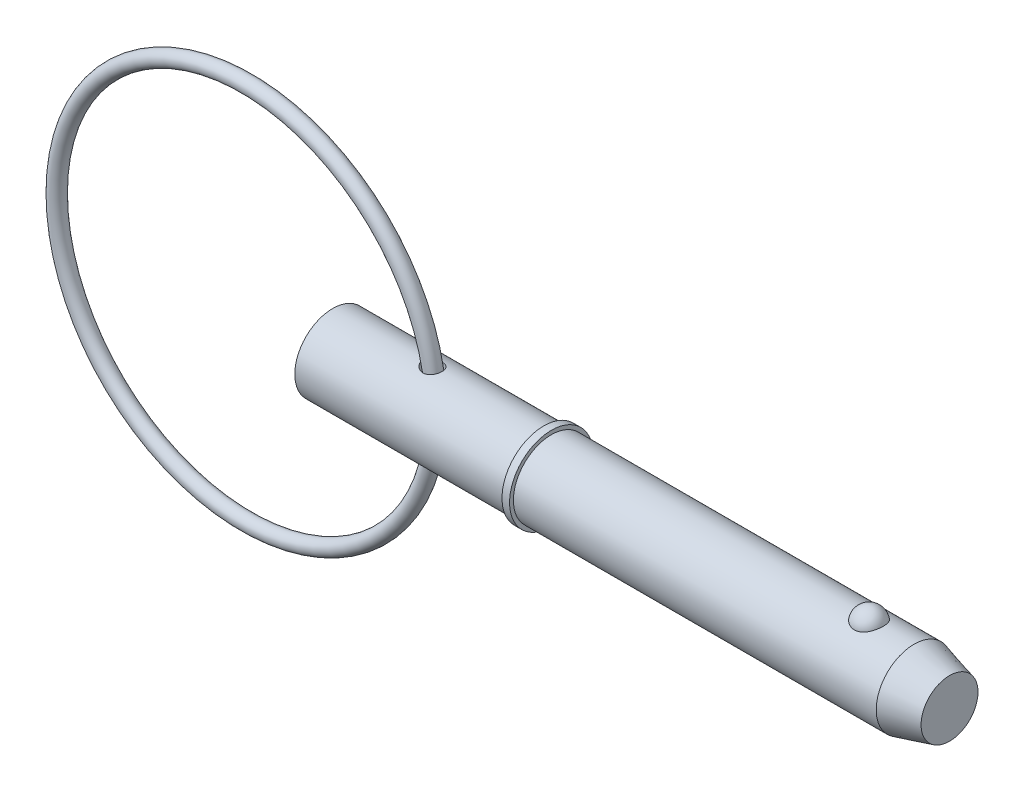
ISO-10303-21;
HEADER;
FILE_DESCRIPTION(('STEP AP214'),'2;1');
FILE_NAME('part.step','',(''),(''),'','','');
FILE_SCHEMA(('AUTOMOTIVE_DESIGN { 1 0 10303 214 1 1 1 1 }'));
ENDSEC;
DATA;
#1=APPLICATION_CONTEXT('core data for automotive mechanical design processes');
#2=APPLICATION_PROTOCOL_DEFINITION('international standard','automotive_design',2000,#1);
#3=PRODUCT_CONTEXT('',#1,'mechanical');
#4=PRODUCT('Part','Part','',(#3));
#5=PRODUCT_RELATED_PRODUCT_CATEGORY('part','',(#4));
#6=PRODUCT_DEFINITION_FORMATION('','',#4);
#7=PRODUCT_DEFINITION_CONTEXT('part definition',#1,'design');
#8=PRODUCT_DEFINITION('design','',#6,#7);
#9=PRODUCT_DEFINITION_SHAPE('','',#8);
#10=(LENGTH_UNIT() NAMED_UNIT(*) SI_UNIT(.MILLI.,.METRE.));
#11=(NAMED_UNIT(*) PLANE_ANGLE_UNIT() SI_UNIT($,.RADIAN.));
#12=(NAMED_UNIT(*) SI_UNIT($,.STERADIAN.) SOLID_ANGLE_UNIT());
#13=UNCERTAINTY_MEASURE_WITH_UNIT(LENGTH_MEASURE(1.E-05),#10,'distance_accuracy_value','');
#14=(GEOMETRIC_REPRESENTATION_CONTEXT(3) GLOBAL_UNCERTAINTY_ASSIGNED_CONTEXT((#13)) GLOBAL_UNIT_ASSIGNED_CONTEXT((#10,
#11,#12)) REPRESENTATION_CONTEXT('',''));
#15=CARTESIAN_POINT('',(0.,0.,0.));
#16=DIRECTION('',(0.,0.,1.));
#17=DIRECTION('',(1.,0.,0.));
#18=AXIS2_PLACEMENT_3D('',#15,#16,#17);
#19=CARTESIAN_POINT('',(-7.21857545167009,0.,0.));
#20=DIRECTION('',(0.,0.,1.));
#21=DIRECTION('',(1.,0.,0.));
#22=AXIS2_PLACEMENT_3D('',#19,#20,#21);
#23=TOROIDAL_SURFACE('',#22,15.875,0.634999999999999);
#24=CARTESIAN_POINT('',(9.29142454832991,0.,0.));
#25=VERTEX_POINT('',#24);
#26=VERTEX_LOOP('',#25);
#27=FACE_BOUND('',#26,.T.);
#28=ADVANCED_FACE('P0_F12',(#27),#23,.T.);
#29=CLOSED_SHELL('',(#28));
#30=MANIFOLD_SOLID_BREP('P0_B1',#29);
#31=CARTESIAN_POINT('',(0.,0.,0.));
#32=DIRECTION('',(1.,0.,0.));
#33=DIRECTION('',(0.,0.,-1.));
#34=AXIS2_PLACEMENT_3D('',#31,#32,#33);
#35=CYLINDRICAL_SURFACE('',#34,3.175);
#36=CARTESIAN_POINT('',(7.68750254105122,3.14043953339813,-0.467187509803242));
#37=CARTESIAN_POINT('',(7.71663570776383,3.13485007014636,-0.504758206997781));
#38=CARTESIAN_POINT('',(7.74907441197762,3.12895198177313,-0.539757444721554));
#39=CARTESIAN_POINT('',(7.81944011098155,3.11722901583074,-0.603799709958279));
#40=CARTESIAN_POINT('',(7.85737550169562,3.11140426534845,-0.632833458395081));
#41=CARTESIAN_POINT('',(7.93756775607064,3.10051072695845,-0.684213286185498));
#42=CARTESIAN_POINT('',(7.97981919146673,3.09544100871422,-0.706567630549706));
#43=CARTESIAN_POINT('',(8.06754397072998,3.08665483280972,-0.744015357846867));
#44=CARTESIAN_POINT('',(8.11301598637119,3.08293782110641,-0.759111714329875));
#45=CARTESIAN_POINT('',(8.20614871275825,3.07732974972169,-0.781538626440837));
#46=CARTESIAN_POINT('',(8.25381727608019,3.07544587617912,-0.788838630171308));
#47=CARTESIAN_POINT('',(8.34973955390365,3.07382984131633,-0.795114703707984));
#48=CARTESIAN_POINT('',(8.39799308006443,3.07409700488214,-0.794093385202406));
#49=CARTESIAN_POINT('',(8.4909727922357,3.07673252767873,-0.783815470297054));
#50=CARTESIAN_POINT('',(8.53575064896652,3.07898913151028,-0.774996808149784));
#51=CARTESIAN_POINT('',(8.62301664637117,3.08521060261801,-0.749844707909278));
#52=CARTESIAN_POINT('',(8.66550527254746,3.08917510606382,-0.733512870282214));
#53=CARTESIAN_POINT('',(8.74528857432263,3.09816330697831,-0.694543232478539));
#54=CARTESIAN_POINT('',(8.78272109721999,3.10313973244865,-0.672175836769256));
#55=CARTESIAN_POINT('',(8.85323831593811,3.11368155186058,-0.621513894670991));
#56=CARTESIAN_POINT('',(8.88632295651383,3.1192469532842,-0.59321927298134));
#57=CARTESIAN_POINT('',(8.94738786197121,3.13037258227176,-0.531394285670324));
#58=CARTESIAN_POINT('',(8.97535151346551,3.13593273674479,-0.497847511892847));
#59=CARTESIAN_POINT('',(9.02535984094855,3.14642822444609,-0.426512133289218));
#60=CARTESIAN_POINT('',(9.04740412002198,3.1513635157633,-0.388723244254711));
#61=CARTESIAN_POINT('',(9.08531615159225,3.16014674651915,-0.309373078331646));
#62=CARTESIAN_POINT('',(9.10109111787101,3.16397813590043,-0.267765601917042));
#63=CARTESIAN_POINT('',(9.12562372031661,3.17004373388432,-0.182419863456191));
#64=CARTESIAN_POINT('',(9.13438129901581,3.17227792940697,-0.138681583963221));
#65=CARTESIAN_POINT('',(9.14467797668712,3.17491257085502,-0.0501907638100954));
#66=CARTESIAN_POINT('',(9.14619790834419,3.17530814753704,-0.00543584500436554));
#67=CARTESIAN_POINT('',(9.14192925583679,3.17420952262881,0.0837005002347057));
#68=CARTESIAN_POINT('',(9.13614065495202,3.17271531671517,0.128081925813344));
#69=CARTESIAN_POINT('',(9.11741184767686,3.16800183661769,0.215146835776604));
#70=CARTESIAN_POINT('',(9.1044818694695,3.1647850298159,0.257832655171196));
#71=CARTESIAN_POINT('',(9.07179341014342,3.15697516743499,0.340371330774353));
#72=CARTESIAN_POINT('',(9.05203467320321,3.15238206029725,0.380224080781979));
#73=CARTESIAN_POINT('',(9.00612949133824,3.14231078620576,0.456042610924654));
#74=CARTESIAN_POINT('',(8.97997137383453,3.13683100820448,0.492001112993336));
#75=CARTESIAN_POINT('',(8.92194141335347,3.12560179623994,0.558920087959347));
#76=CARTESIAN_POINT('',(8.89006980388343,3.11985237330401,0.589880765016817));
#77=CARTESIAN_POINT('',(8.82164045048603,3.10876807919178,0.645751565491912));
#78=CARTESIAN_POINT('',(8.78510991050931,3.1034310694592,0.670694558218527));
#79=CARTESIAN_POINT('',(8.70823767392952,3.09374754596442,0.714035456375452));
#80=CARTESIAN_POINT('',(8.66789657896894,3.08940087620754,0.732434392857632));
#81=CARTESIAN_POINT('',(8.58520620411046,3.08224677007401,0.761976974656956));
#82=CARTESIAN_POINT('',(8.54289637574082,3.07941711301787,0.773225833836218));
#83=CARTESIAN_POINT('',(8.45693772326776,3.07549224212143,0.788693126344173));
#84=CARTESIAN_POINT('',(8.41328889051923,3.07439703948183,0.792911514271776));
#85=CARTESIAN_POINT('',(8.32565716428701,3.07402154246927,0.79436569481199));
#86=CARTESIAN_POINT('',(8.2816736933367,3.07475037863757,0.791566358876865));
#87=CARTESIAN_POINT('',(8.19474198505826,3.0779150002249,0.779168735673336));
#88=CARTESIAN_POINT('',(8.15179398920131,3.0803511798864,0.769568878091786));
#89=CARTESIAN_POINT('',(8.06605600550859,3.08678050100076,0.743371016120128));
#90=CARTESIAN_POINT('',(8.02336243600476,3.09083954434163,0.726473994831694));
#91=CARTESIAN_POINT('',(7.94127890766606,3.10003371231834,0.686178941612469));
#92=CARTESIAN_POINT('',(7.90189016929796,3.10516923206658,0.662778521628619));
#93=CARTESIAN_POINT('',(7.82556689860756,3.11622820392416,0.608722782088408));
#94=CARTESIAN_POINT('',(7.78884764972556,3.12217795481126,0.577767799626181));
#95=CARTESIAN_POINT('',(7.7212485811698,3.13396160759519,0.509990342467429));
#96=CARTESIAN_POINT('',(7.69036894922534,3.13979550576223,0.473167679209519));
#97=CARTESIAN_POINT('',(7.63604128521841,3.15055792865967,0.395137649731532));
#98=CARTESIAN_POINT('',(7.61248286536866,3.15549937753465,0.354009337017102));
#99=CARTESIAN_POINT('',(7.57323986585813,3.16396081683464,0.268021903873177));
#100=CARTESIAN_POINT('',(7.55754910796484,3.16748192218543,0.223165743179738));
#101=CARTESIAN_POINT('',(7.53586686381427,3.17240393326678,0.135111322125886));
#102=CARTESIAN_POINT('',(7.52916366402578,3.17395975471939,0.0920967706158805));
#103=CARTESIAN_POINT('',(7.52342449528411,3.1752897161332,0.00553088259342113));
#104=CARTESIAN_POINT('',(7.52438648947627,3.17506432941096,-0.0380203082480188));
#105=CARTESIAN_POINT('',(7.53361123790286,3.17293298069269,-0.121469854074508));
#106=CARTESIAN_POINT('',(7.54140526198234,3.17113493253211,-0.161424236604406));
#107=CARTESIAN_POINT('',(7.56329403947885,3.16619862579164,-0.239454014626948));
#108=CARTESIAN_POINT('',(7.57738500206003,3.16306117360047,-0.277530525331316));
#109=CARTESIAN_POINT('',(7.60689714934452,3.15670852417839,-0.341419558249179));
#110=CARTESIAN_POINT('',(7.62103486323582,3.15372268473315,-0.367859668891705));
#111=CARTESIAN_POINT('',(7.65218035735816,3.14734507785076,-0.418934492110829));
#112=CARTESIAN_POINT('',(7.66918829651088,3.14395328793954,-0.443569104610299));
#113=CARTESIAN_POINT('',(7.68750254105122,3.14043953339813,-0.467187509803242));
#114=B_SPLINE_CURVE_WITH_KNOTS('',3,(#36,#37,#38,#39,#40,#41,#42,#43,#44,#45,#46,#47,#48,#49,
#50,#51,#52,#53,#54,#55,#56,#57,#58,#59,#60,#61,#62,#63,#64,#65,#66,#67,#68,#69,#70,#71,#72,#73,
#74,#75,#76,#77,#78,#79,#80,#81,#82,#83,#84,#85,#86,#87,#88,#89,#90,#91,#92,#93,#94,#95,#96,#97,
#98,#99,#100,#101,#102,#103,#104,#105,#106,#107,#108,#109,#110,#111,#112,#113),.UNSPECIFIED.,
.T.,.F.,(4,2,2,2,2,2,2,2,2,2,2,2,2,2,2,2,2,2,2,2,2,2,2,2,2,2,2,2,2,2,2,2,2,2,2,2,2,2,4),(0.,
0.143496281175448,0.287214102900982,0.430753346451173,0.574233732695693,0.71827434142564,
0.862269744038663,0.998657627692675,1.13501647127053,1.26606395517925,1.39711310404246,
1.52858014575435,1.66005600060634,1.79341107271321,1.92676723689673,2.06047636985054,
2.19418580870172,2.32770423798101,2.46122766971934,2.59499649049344,2.72875984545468,
2.86177513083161,2.99476944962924,3.12575845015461,3.25674829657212,3.38839514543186,
3.5200724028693,3.65775119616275,3.79548061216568,3.93996868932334,4.08446141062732,
4.22665598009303,4.36873871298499,4.49873145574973,4.62868965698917,4.7503735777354,
4.87198434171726,4.96218670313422,5.05239406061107),.UNSPECIFIED.);
#115=CARTESIAN_POINT('',(7.68750254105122,3.14043953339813,-0.467187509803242));
#116=VERTEX_POINT('',#115);
#117=EDGE_CURVE('P1_E42',#116,#116,#114,.T.);
#118=ORIENTED_EDGE('',*,*,#117,.T.);
#119=EDGE_LOOP('',(#118));
#120=FACE_BOUND('',#119,.T.);
#121=CARTESIAN_POINT('',(0.,0.,0.));
#122=DIRECTION('',(1.,0.,0.));
#123=DIRECTION('',(0.,0.,-1.));
#124=AXIS2_PLACEMENT_3D('',#121,#122,#123);
#125=CIRCLE('',#124,3.175);
#126=CARTESIAN_POINT('',(0.,0.,-3.175));
#127=VERTEX_POINT('',#126);
#128=EDGE_CURVE('P1_E9',#127,#127,#125,.T.);
#129=ORIENTED_EDGE('',*,*,#128,.T.);
#130=EDGE_LOOP('',(#129));
#131=FACE_BOUND('',#130,.T.);
#132=CARTESIAN_POINT('',(17.655,0.,0.));
#133=DIRECTION('',(1.,0.,0.));
#134=DIRECTION('',(0.,0.,-1.));
#135=AXIS2_PLACEMENT_3D('',#132,#133,#134);
#136=CIRCLE('',#135,3.175);
#137=CARTESIAN_POINT('',(17.655,0.,-3.175));
#138=VERTEX_POINT('',#137);
#139=EDGE_CURVE('P1_E25',#138,#138,#136,.T.);
#140=ORIENTED_EDGE('',*,*,#139,.F.);
#141=EDGE_LOOP('',(#140));
#142=FACE_BOUND('',#141,.T.);
#143=CARTESIAN_POINT('',(7.68750254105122,-3.14043953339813,-0.467187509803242));
#144=CARTESIAN_POINT('',(7.66134108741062,-3.14545876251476,-0.433446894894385));
#145=CARTESIAN_POINT('',(7.63782862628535,-3.15023199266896,-0.397612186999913));
#146=CARTESIAN_POINT('',(7.59691922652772,-3.15880505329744,-0.322493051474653));
#147=CARTESIAN_POINT('',(7.57952031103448,-3.16260519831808,-0.283209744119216));
#148=CARTESIAN_POINT('',(7.55152687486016,-3.16882833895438,-0.202021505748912));
#149=CARTESIAN_POINT('',(7.54095517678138,-3.17124671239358,-0.160108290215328));
#150=CARTESIAN_POINT('',(7.52724513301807,-3.1743985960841,-0.0750206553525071));
#151=CARTESIAN_POINT('',(7.52410469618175,-3.17513258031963,-0.031846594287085));
#152=CARTESIAN_POINT('',(7.5253875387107,-3.17483506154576,0.0522260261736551));
#153=CARTESIAN_POINT('',(7.52944265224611,-3.17388949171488,0.0931310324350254));
#154=CARTESIAN_POINT('',(7.54421042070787,-3.17050389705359,0.1736507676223));
#155=CARTESIAN_POINT('',(7.5549232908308,-3.16806382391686,0.213265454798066));
#156=CARTESIAN_POINT('',(7.58252065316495,-3.16195002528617,0.290147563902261));
#157=CARTESIAN_POINT('',(7.59940259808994,-3.15827680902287,0.32741594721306));
#158=CARTESIAN_POINT('',(7.63869293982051,-3.15005936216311,0.398803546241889));
#159=CARTESIAN_POINT('',(7.66110286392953,-3.14551489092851,0.432921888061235));
#160=CARTESIAN_POINT('',(7.71258278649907,-3.13561737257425,0.49975352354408));
#161=CARTESIAN_POINT('',(7.74202268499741,-3.13022938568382,0.532176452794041));
#162=CARTESIAN_POINT('',(7.80559890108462,-3.11946135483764,0.592041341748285));
#163=CARTESIAN_POINT('',(7.83973728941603,-3.11408131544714,0.619481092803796));
#164=CARTESIAN_POINT('',(7.91474520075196,-3.10344314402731,0.670826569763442));
#165=CARTESIAN_POINT('',(7.95593439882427,-3.09822894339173,0.694276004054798));
#166=CARTESIAN_POINT('',(8.04171965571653,-3.08902387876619,0.734150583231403));
#167=CARTESIAN_POINT('',(8.08631621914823,-3.08503319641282,0.750574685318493));
#168=CARTESIAN_POINT('',(8.17840269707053,-3.07873340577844,0.776016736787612));
#169=CARTESIAN_POINT('',(8.22592511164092,-3.07644943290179,0.784924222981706));
#170=CARTESIAN_POINT('',(8.3218479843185,-3.07400734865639,0.79443684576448));
#171=CARTESIAN_POINT('',(8.37024809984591,-3.07384842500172,0.79504515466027));
#172=CARTESIAN_POINT('',(8.46394967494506,-3.07568838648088,0.787894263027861));
#173=CARTESIAN_POINT('',(8.50928504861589,-3.07757975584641,0.78055200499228));
#174=CARTESIAN_POINT('',(8.5979121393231,-3.0831587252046,0.758214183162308));
#175=CARTESIAN_POINT('',(8.6412043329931,-3.08684590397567,0.743220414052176));
#176=CARTESIAN_POINT('',(8.72259527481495,-3.09539071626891,0.706762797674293));
#177=CARTESIAN_POINT('',(8.7608371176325,-3.10019138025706,0.685603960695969));
#178=CARTESIAN_POINT('',(8.83314563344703,-3.11049979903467,0.637201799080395));
#179=CARTESIAN_POINT('',(8.86721230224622,-3.11600755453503,0.609958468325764));
#180=CARTESIAN_POINT('',(8.93027727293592,-3.12712026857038,0.550151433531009));
#181=CARTESIAN_POINT('',(8.95927559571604,-3.13272522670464,0.517587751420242));
#182=CARTESIAN_POINT('',(9.01149093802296,-3.14342495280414,0.448041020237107));
#183=CARTESIAN_POINT('',(9.03470756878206,-3.14851968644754,0.411057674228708));
#184=CARTESIAN_POINT('',(9.07510046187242,-3.15772445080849,0.333109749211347));
#185=CARTESIAN_POINT('',(9.09218248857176,-3.16181883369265,0.292094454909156));
#186=CARTESIAN_POINT('',(9.11940464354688,-3.16848144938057,0.207703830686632));
#187=CARTESIAN_POINT('',(9.12954467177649,-3.17104966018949,0.164328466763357));
#188=CARTESIAN_POINT('',(9.14265964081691,-3.17439058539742,0.0762710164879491));
#189=CARTESIAN_POINT('',(9.14560734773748,-3.17515647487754,0.0315846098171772));
#190=CARTESIAN_POINT('',(9.14418482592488,-3.1747899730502,-0.0576634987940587));
#191=CARTESIAN_POINT('',(9.13981460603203,-3.17365758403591,-0.102225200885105));
#192=CARTESIAN_POINT('',(9.12387791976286,-3.1696201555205,-0.189883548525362));
#193=CARTESIAN_POINT('',(9.11232323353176,-3.16671801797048,-0.232982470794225));
#194=CARTESIAN_POINT('',(9.08231097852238,-3.15945654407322,-0.316576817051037));
#195=CARTESIAN_POINT('',(9.06385315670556,-3.15509715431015,-0.357072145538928));
#196=CARTESIAN_POINT('',(9.02044668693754,-3.14538636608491,-0.434386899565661));
#197=CARTESIAN_POINT('',(8.99548654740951,-3.14003321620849,-0.471199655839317));
#198=CARTESIAN_POINT('',(8.93971208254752,-3.12893289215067,-0.540019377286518));
#199=CARTESIAN_POINT('',(8.9088979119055,-3.12318572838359,-0.572026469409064));
#200=CARTESIAN_POINT('',(8.84235816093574,-3.11197156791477,-0.630185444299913));
#201=CARTESIAN_POINT('',(8.80665432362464,-3.10650347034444,-0.656361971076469));
#202=CARTESIAN_POINT('',(8.73121463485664,-3.09644726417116,-0.702277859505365));
#203=CARTESIAN_POINT('',(8.69147940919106,-3.0918590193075,-0.722018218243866));
#204=CARTESIAN_POINT('',(8.60974645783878,-3.08414607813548,-0.754281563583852));
#205=CARTESIAN_POINT('',(8.56779175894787,-3.08100040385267,-0.766908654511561));
#206=CARTESIAN_POINT('',(8.48229847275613,-3.07640651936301,-0.785135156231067));
#207=CARTESIAN_POINT('',(8.4387599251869,-3.07495826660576,-0.790734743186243));
#208=CARTESIAN_POINT('',(8.35126980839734,-3.07388240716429,-0.794906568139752));
#209=CARTESIAN_POINT('',(8.30731772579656,-3.07425748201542,-0.79346845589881));
#210=CARTESIAN_POINT('',(8.22022709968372,-3.07674606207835,-0.783761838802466));
#211=CARTESIAN_POINT('',(8.17708875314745,-3.07885998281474,-0.775491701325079));
#212=CARTESIAN_POINT('',(8.09089465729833,-3.08468414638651,-0.751997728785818));
#213=CARTESIAN_POINT('',(8.0479194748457,-3.08845808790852,-0.736494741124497));
#214=CARTESIAN_POINT('',(7.96504527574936,-3.09716853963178,-0.698957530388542));
#215=CARTESIAN_POINT('',(7.92514708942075,-3.10210536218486,-0.676921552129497));
#216=CARTESIAN_POINT('',(7.8492503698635,-3.11263013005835,-0.626751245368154));
#217=CARTESIAN_POINT('',(7.81326800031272,-3.11822059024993,-0.598592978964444));
#218=CARTESIAN_POINT('',(7.74635335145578,-3.12944726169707,-0.53681285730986));
#219=CARTESIAN_POINT('',(7.71541970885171,-3.13508346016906,-0.503192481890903));
#220=CARTESIAN_POINT('',(7.68750254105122,-3.14043953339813,-0.467187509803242));
#221=B_SPLINE_CURVE_WITH_KNOTS('',3,(#143,#144,#145,#146,#147,#148,#149,#150,#151,#152,#153,
#154,#155,#156,#157,#158,#159,#160,#161,#162,#163,#164,#165,#166,#167,#168,#169,#170,#171,#172,
#173,#174,#175,#176,#177,#178,#179,#180,#181,#182,#183,#184,#185,#186,#187,#188,#189,#190,#191,
#192,#193,#194,#195,#196,#197,#198,#199,#200,#201,#202,#203,#204,#205,#206,#207,#208,#209,#210,
#211,#212,#213,#214,#215,#216,#217,#218,#219,#220),.UNSPECIFIED.,.T.,.F.,(4,2,2,2,2,2,2,2,2,2,2,
2,2,2,2,2,2,2,2,2,2,2,2,2,2,2,2,2,2,2,2,2,2,2,2,2,2,2,4),(0.,0.128825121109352,
0.257608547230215,0.386820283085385,0.515995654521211,0.638750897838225,0.761510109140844,
0.884218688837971,1.00696120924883,1.13877828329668,1.27065363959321,1.41304496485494,
1.55545741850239,1.69992800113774,1.84434335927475,1.98153642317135,2.11869732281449,
2.24997668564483,2.38125618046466,2.51253513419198,2.64382291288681,2.77704892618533,
2.91027685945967,3.04400848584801,3.17773995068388,3.31125271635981,3.44477037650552,
3.5785256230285,3.71227733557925,3.84545251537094,3.97860705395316,4.10975853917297,
4.24090673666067,4.37224786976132,4.50362039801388,4.64054596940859,4.77750836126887,
4.91501622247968,5.05248689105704),.UNSPECIFIED.);
#222=CARTESIAN_POINT('',(7.68750254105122,-3.14043953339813,-0.467187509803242));
#223=VERTEX_POINT('',#222);
#224=EDGE_CURVE('P1_E17',#223,#223,#221,.T.);
#225=ORIENTED_EDGE('',*,*,#224,.T.);
#226=EDGE_LOOP('',(#225));
#227=FACE_BOUND('',#226,.T.);
#228=ADVANCED_FACE('P1_F13',(#120,#131,#142,#227),#35,.T.);
#229=CARTESIAN_POINT('',(0.,0.,0.));
#230=DIRECTION('',(1.,0.,0.));
#231=DIRECTION('',(0.,0.,-1.));
#232=AXIS2_PLACEMENT_3D('',#229,#230,#231);
#233=CYLINDRICAL_SURFACE('',#232,3.175);
#234=CARTESIAN_POINT('',(48.6476846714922,0.,0.));
#235=DIRECTION('',(1.,0.,0.));
#236=DIRECTION('',(0.,0.,-1.));
#237=AXIS2_PLACEMENT_3D('',#234,#235,#236);
#238=CIRCLE('',#237,3.175);
#239=CARTESIAN_POINT('',(48.6476846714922,0.,-3.175));
#240=VERTEX_POINT('',#239);
#241=EDGE_CURVE('P1_E99',#240,#240,#238,.T.);
#242=ORIENTED_EDGE('',*,*,#241,.F.);
#243=EDGE_LOOP('',(#242));
#244=FACE_BOUND('',#243,.T.);
#245=CARTESIAN_POINT('',(18.29,0.,0.));
#246=DIRECTION('',(1.,0.,0.));
#247=DIRECTION('',(0.,0.,-1.));
#248=AXIS2_PLACEMENT_3D('',#245,#246,#247);
#249=CIRCLE('',#248,3.175);
#250=CARTESIAN_POINT('',(18.29,0.,-3.175));
#251=VERTEX_POINT('',#250);
#252=EDGE_CURVE('P1_E96',#251,#251,#249,.T.);
#253=ORIENTED_EDGE('',*,*,#252,.T.);
#254=EDGE_LOOP('',(#253));
#255=FACE_BOUND('',#254,.T.);
#256=CARTESIAN_POINT('',(44.8757276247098,2.92898950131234,1.22541646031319));
#257=CARTESIAN_POINT('',(44.812316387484,2.92899434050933,1.22541146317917));
#258=CARTESIAN_POINT('',(44.7487979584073,2.93112688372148,1.22034641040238));
#259=CARTESIAN_POINT('',(44.6235306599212,2.93942752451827,1.20020949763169));
#260=CARTESIAN_POINT('',(44.5617869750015,2.94560639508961,1.18511092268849));
#261=CARTESIAN_POINT('',(44.4420651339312,2.96127115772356,1.1454035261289));
#262=CARTESIAN_POINT('',(44.3840775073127,2.97074831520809,1.1208198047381));
#263=CARTESIAN_POINT('',(44.2731943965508,2.99197584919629,1.06285154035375));
#264=CARTESIAN_POINT('',(44.2202966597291,3.0037252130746,1.02947091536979));
#265=CARTESIAN_POINT('',(44.1192688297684,3.02865714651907,0.953674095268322));
#266=CARTESIAN_POINT('',(44.071324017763,3.04187163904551,0.911021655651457));
#267=CARTESIAN_POINT('',(43.9830360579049,3.06808741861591,0.818400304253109));
#268=CARTESIAN_POINT('',(43.9426952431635,3.08108863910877,0.768429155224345));
#269=CARTESIAN_POINT('',(43.8688039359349,3.10614903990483,0.660064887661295));
#270=CARTESIAN_POINT('',(43.8356330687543,3.11814104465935,0.601396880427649));
#271=CARTESIAN_POINT('',(43.7791190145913,3.13926931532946,0.479026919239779));
#272=CARTESIAN_POINT('',(43.7557764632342,3.14840539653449,0.415324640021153));
#273=CARTESIAN_POINT('',(43.7191785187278,3.16298160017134,0.283885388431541));
#274=CARTESIAN_POINT('',(43.7060407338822,3.16837855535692,0.216110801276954));
#275=CARTESIAN_POINT('',(43.6905676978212,3.17475386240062,0.0791367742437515));
#276=CARTESIAN_POINT('',(43.688232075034,3.17573236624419,0.00993738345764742));
#277=CARTESIAN_POINT('',(43.694388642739,3.17318075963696,-0.127420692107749));
#278=CARTESIAN_POINT('',(43.7028073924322,3.16968122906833,-0.195583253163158));
#279=CARTESIAN_POINT('',(43.7301752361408,3.1585790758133,-0.329413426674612));
#280=CARTESIAN_POINT('',(43.7491245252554,3.15097637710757,-0.395080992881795));
#281=CARTESIAN_POINT('',(43.7972057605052,3.13242485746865,-0.522180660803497));
#282=CARTESIAN_POINT('',(43.8263524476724,3.12147119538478,-0.5836064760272));
#283=CARTESIAN_POINT('',(43.8942352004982,3.09734973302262,-0.700436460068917));
#284=CARTESIAN_POINT('',(43.932972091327,3.08418174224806,-0.75584011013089));
#285=CARTESIAN_POINT('',(44.0194771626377,3.05694884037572,-0.859404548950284));
#286=CARTESIAN_POINT('',(44.0672961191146,3.04287919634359,-0.907521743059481));
#287=CARTESIAN_POINT('',(44.1707353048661,3.01548927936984,-0.994758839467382));
#288=CARTESIAN_POINT('',(44.2263549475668,3.0021689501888,-1.03387941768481));
#289=CARTESIAN_POINT('',(44.3428093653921,2.97810316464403,-1.10126594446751));
#290=CARTESIAN_POINT('',(44.4035182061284,2.96731170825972,-1.12973256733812));
#291=CARTESIAN_POINT('',(44.5293712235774,2.94928934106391,-1.17598467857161));
#292=CARTESIAN_POINT('',(44.5945137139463,2.94205708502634,-1.19377420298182));
#293=CARTESIAN_POINT('',(44.7238562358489,2.93233065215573,-1.2174638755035));
#294=CARTESIAN_POINT('',(44.7879385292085,2.92961621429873,-1.22391763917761));
#295=CARTESIAN_POINT('',(44.9163375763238,2.92855752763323,-1.22644976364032));
#296=CARTESIAN_POINT('',(44.980654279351,2.93021238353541,-1.22253024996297));
#297=CARTESIAN_POINT('',(45.1055239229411,2.93756851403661,-1.20474140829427));
#298=CARTESIAN_POINT('',(45.166131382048,2.94313790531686,-1.1911962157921));
#299=CARTESIAN_POINT('',(45.2841106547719,2.95756226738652,-1.15491492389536));
#300=CARTESIAN_POINT('',(45.3414822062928,2.96641750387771,-1.13217808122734));
#301=CARTESIAN_POINT('',(45.4527699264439,2.98669918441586,-1.07755083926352));
#302=CARTESIAN_POINT('',(45.5065845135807,2.9981771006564,-1.04547308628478));
#303=CARTESIAN_POINT('',(45.6081473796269,3.02240235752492,-0.973220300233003));
#304=CARTESIAN_POINT('',(45.6558942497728,3.03514999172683,-0.933043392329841));
#305=CARTESIAN_POINT('',(45.7465817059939,3.06131230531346,-0.843372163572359));
#306=CARTESIAN_POINT('',(45.7891588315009,3.07472822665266,-0.793510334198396));
#307=CARTESIAN_POINT('',(45.8656765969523,3.10021106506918,-0.687241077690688));
#308=CARTESIAN_POINT('',(45.8996156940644,3.1122777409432,-0.630832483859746));
#309=CARTESIAN_POINT('',(45.9591209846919,3.134208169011,-0.511059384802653));
#310=CARTESIAN_POINT('',(45.9843892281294,3.14399040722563,-0.447531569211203));
#311=CARTESIAN_POINT('',(46.0245117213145,3.15983820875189,-0.316827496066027));
#312=CARTESIAN_POINT('',(46.0393659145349,3.16590375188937,-0.249651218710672));
#313=CARTESIAN_POINT('',(46.0583586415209,3.17370076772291,-0.113549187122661));
#314=CARTESIAN_POINT('',(46.0624966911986,3.17543204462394,-0.0446233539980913));
#315=CARTESIAN_POINT('',(46.0599697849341,3.17438372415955,0.0929938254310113));
#316=CARTESIAN_POINT('',(46.053305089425,3.17160423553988,0.161685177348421));
#317=CARTESIAN_POINT('',(46.0293754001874,3.1618438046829,0.296502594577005));
#318=CARTESIAN_POINT('',(46.0121674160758,3.15488546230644,0.362640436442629));
#319=CARTESIAN_POINT('',(45.967547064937,3.13748892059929,0.490896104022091));
#320=CARTESIAN_POINT('',(45.9401339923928,3.12705048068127,0.553013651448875));
#321=CARTESIAN_POINT('',(45.8754626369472,3.10369139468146,0.671876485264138));
#322=CARTESIAN_POINT('',(45.8381467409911,3.0907563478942,0.728587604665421));
#323=CARTESIAN_POINT('',(45.7545246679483,3.06381731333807,0.834653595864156));
#324=CARTESIAN_POINT('',(45.7082189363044,3.04981337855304,0.88400883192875));
#325=CARTESIAN_POINT('',(45.6077184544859,3.02230423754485,0.973916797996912));
#326=CARTESIAN_POINT('',(45.553535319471,3.00879833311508,1.01448227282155));
#327=CARTESIAN_POINT('',(45.4385299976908,2.98383625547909,1.08571550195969));
#328=CARTESIAN_POINT('',(45.3777053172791,2.97238085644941,1.11637952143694));
#329=CARTESIAN_POINT('',(45.2533690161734,2.95329063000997,1.16592590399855));
#330=CARTESIAN_POINT('',(45.1900230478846,2.94553738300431,1.1851790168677));
#331=CARTESIAN_POINT('',(45.0607664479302,2.9342556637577,1.2128480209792));
#332=CARTESIAN_POINT('',(44.9948641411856,2.93071450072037,1.22129647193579));
#333=CARTESIAN_POINT('',(44.911116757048,2.9291525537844,1.22502505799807));
#334=CARTESIAN_POINT('',(44.8934263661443,2.9289881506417,1.22541785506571));
#335=CARTESIAN_POINT('',(44.8757276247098,2.92898950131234,1.22541646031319));
#336=B_SPLINE_CURVE_WITH_KNOTS('',3,(#256,#257,#258,#259,#260,#261,#262,#263,#264,#265,#266,
#267,#268,#269,#270,#271,#272,#273,#274,#275,#276,#277,#278,#279,#280,#281,#282,#283,#284,#285,
#286,#287,#288,#289,#290,#291,#292,#293,#294,#295,#296,#297,#298,#299,#300,#301,#302,#303,#304,
#305,#306,#307,#308,#309,#310,#311,#312,#313,#314,#315,#316,#317,#318,#319,#320,#321,#322,#323,
#324,#325,#326,#327,#328,#329,#330,#331,#332,#333,#334,#335),.UNSPECIFIED.,.T.,.F.,(4,2,2,2,2,2,
2,2,2,2,2,2,2,2,2,2,2,2,2,2,2,2,2,2,2,2,2,2,2,2,2,2,2,2,2,2,2,2,2,4),(0.,0.190186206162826,
0.380880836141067,0.571074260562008,0.76118311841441,0.956866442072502,1.15260970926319,
1.35701770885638,1.56143892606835,1.76818248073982,1.97491892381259,2.18025109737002,
2.38558707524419,2.59122111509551,2.79687285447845,3.00371012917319,3.21053185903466,
3.41323429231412,3.6158600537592,3.80828192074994,4.00066436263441,4.18685798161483,
4.37306665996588,4.56330302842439,4.75358348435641,4.95345287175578,5.1533579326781,
5.35957003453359,5.56578325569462,5.77200579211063,5.97822335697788,6.18333558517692,
6.38846199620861,6.59480900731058,6.80114579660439,7.00718137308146,7.21329457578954,
7.41228022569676,7.61066481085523,7.66374777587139),.UNSPECIFIED.);
#337=CARTESIAN_POINT('',(44.8757276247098,2.92898950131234,1.22541646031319));
#338=VERTEX_POINT('',#337);
#339=EDGE_CURVE('P1_E34',#338,#338,#336,.T.);
#340=ORIENTED_EDGE('',*,*,#339,.T.);
#341=EDGE_LOOP('',(#340));
#342=FACE_BOUND('',#341,.T.);
#343=ADVANCED_FACE('P1_F46',(#244,#255,#342),#233,.T.);
#344=CARTESIAN_POINT('',(0.,0.,0.));
#345=DIRECTION('',(-1.,0.,0.));
#346=DIRECTION('',(0.,0.,1.));
#347=AXIS2_PLACEMENT_3D('',#344,#345,#346);
#348=PLANE('',#347);
#349=ORIENTED_EDGE('',*,*,#128,.F.);
#350=EDGE_LOOP('',(#349));
#351=FACE_BOUND('',#350,.T.);
#352=ADVANCED_FACE('P1_F15',(#351),#348,.T.);
#353=CARTESIAN_POINT('',(17.655,3.175,0.));
#354=DIRECTION('',(-1.,0.,0.));
#355=DIRECTION('',(0.,0.,1.));
#356=AXIS2_PLACEMENT_3D('',#353,#354,#355);
#357=PLANE('',#356);
#358=ORIENTED_EDGE('',*,*,#139,.T.);
#359=EDGE_LOOP('',(#358));
#360=FACE_BOUND('',#359,.T.);
#361=CARTESIAN_POINT('',(17.655,0.,0.));
#362=DIRECTION('',(1.,0.,0.));
#363=DIRECTION('',(0.,0.,-1.));
#364=AXIS2_PLACEMENT_3D('',#361,#362,#363);
#365=CIRCLE('',#364,3.4925);
#366=CARTESIAN_POINT('',(17.655,0.,-3.4925));
#367=VERTEX_POINT('',#366);
#368=EDGE_CURVE('P1_E30',#367,#367,#365,.T.);
#369=ORIENTED_EDGE('',*,*,#368,.F.);
#370=EDGE_LOOP('',(#369));
#371=FACE_BOUND('',#370,.T.);
#372=ADVANCED_FACE('P1_F81',(#360,#371),#357,.T.);
#373=CARTESIAN_POINT('',(0.,0.,0.));
#374=DIRECTION('',(1.,0.,0.));
#375=DIRECTION('',(0.,0.,-1.));
#376=AXIS2_PLACEMENT_3D('',#373,#374,#375);
#377=CYLINDRICAL_SURFACE('',#376,3.4925);
#378=ORIENTED_EDGE('',*,*,#368,.T.);
#379=EDGE_LOOP('',(#378));
#380=FACE_BOUND('',#379,.T.);
#381=CARTESIAN_POINT('',(18.29,0.,0.));
#382=DIRECTION('',(1.,0.,0.));
#383=DIRECTION('',(0.,0.,-1.));
#384=AXIS2_PLACEMENT_3D('',#381,#382,#383);
#385=CIRCLE('',#384,3.4925);
#386=CARTESIAN_POINT('',(18.29,0.,-3.4925));
#387=VERTEX_POINT('',#386);
#388=EDGE_CURVE('P1_E95',#387,#387,#385,.T.);
#389=ORIENTED_EDGE('',*,*,#388,.F.);
#390=EDGE_LOOP('',(#389));
#391=FACE_BOUND('',#390,.T.);
#392=ADVANCED_FACE('P1_F68',(#380,#391),#377,.T.);
#393=CARTESIAN_POINT('',(18.29,3.4925,0.));
#394=DIRECTION('',(1.,0.,0.));
#395=DIRECTION('',(0.,0.,-1.));
#396=AXIS2_PLACEMENT_3D('',#393,#394,#395);
#397=PLANE('',#396);
#398=ORIENTED_EDGE('',*,*,#388,.T.);
#399=EDGE_LOOP('',(#398));
#400=FACE_BOUND('',#399,.T.);
#401=ORIENTED_EDGE('',*,*,#252,.F.);
#402=EDGE_LOOP('',(#401));
#403=FACE_BOUND('',#402,.T.);
#404=ADVANCED_FACE('P1_F62',(#400,#403),#397,.T.);
#405=CARTESIAN_POINT('',(51.61,0.,0.));
#406=DIRECTION('',(-1.,0.,0.));
#407=DIRECTION('',(0.,0.,1.));
#408=AXIS2_PLACEMENT_3D('',#405,#406,#407);
#409=CONICAL_SURFACE('',#408,2.38125000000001,0.26179938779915);
#410=ORIENTED_EDGE('',*,*,#241,.T.);
#411=EDGE_LOOP('',(#410));
#412=FACE_BOUND('',#411,.T.);
#413=CARTESIAN_POINT('',(51.61,0.,0.));
#414=DIRECTION('',(1.,0.,0.));
#415=DIRECTION('',(0.,0.,-1.));
#416=AXIS2_PLACEMENT_3D('',#413,#414,#415);
#417=CIRCLE('',#416,2.38125000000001);
#418=CARTESIAN_POINT('',(51.61,0.,-2.38125000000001));
#419=VERTEX_POINT('',#418);
#420=EDGE_CURVE('P1_E41',#419,#419,#417,.T.);
#421=ORIENTED_EDGE('',*,*,#420,.F.);
#422=EDGE_LOOP('',(#421));
#423=FACE_BOUND('',#422,.T.);
#424=ADVANCED_FACE('P1_F59',(#412,#423),#409,.T.);
#425=CARTESIAN_POINT('',(51.61,2.38125000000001,0.));
#426=DIRECTION('',(1.,0.,0.));
#427=DIRECTION('',(0.,0.,-1.));
#428=AXIS2_PLACEMENT_3D('',#425,#426,#427);
#429=PLANE('',#428);
#430=ORIENTED_EDGE('',*,*,#420,.T.);
#431=EDGE_LOOP('',(#430));
#432=FACE_BOUND('',#431,.T.);
#433=ADVANCED_FACE('P1_F55',(#432),#429,.T.);
#434=CARTESIAN_POINT('',(44.8757276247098,2.8575,0.));
#435=DIRECTION('',(-1.,0.,0.));
#436=DIRECTION('',(0.,1.,0.));
#437=AXIS2_PLACEMENT_3D('',#434,#435,#436);
#438=SPHERICAL_SURFACE('',#437,1.22749999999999);
#439=ORIENTED_EDGE('',*,*,#339,.F.);
#440=EDGE_LOOP('',(#439));
#441=FACE_BOUND('',#440,.T.);
#442=ADVANCED_FACE('P1_F50',(#441),#438,.T.);
#443=CARTESIAN_POINT('',(-7.21857545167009,0.,0.));
#444=DIRECTION('',(0.,0.,1.));
#445=DIRECTION('',(1.,0.,0.));
#446=AXIS2_PLACEMENT_3D('',#443,#444,#445);
#447=TOROIDAL_SURFACE('',#446,15.875,0.793749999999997);
#448=ORIENTED_EDGE('',*,*,#224,.F.);
#449=EDGE_LOOP('',(#448));
#450=FACE_BOUND('',#449,.T.);
#451=ORIENTED_EDGE('',*,*,#117,.F.);
#452=EDGE_LOOP('',(#451));
#453=FACE_BOUND('',#452,.T.);
#454=ADVANCED_FACE('P1_F54',(#450,#453),#447,.F.);
#455=CLOSED_SHELL('',(#228,#343,#352,#372,#392,#404,#424,#433,#442,#454));
#456=MANIFOLD_SOLID_BREP('P1_B1',#455);
#457=ADVANCED_BREP_SHAPE_REPRESENTATION('',(#18,#30,#456),#14);
#458=SHAPE_DEFINITION_REPRESENTATION(#9,#457);
ENDSEC;
END-ISO-10303-21;
